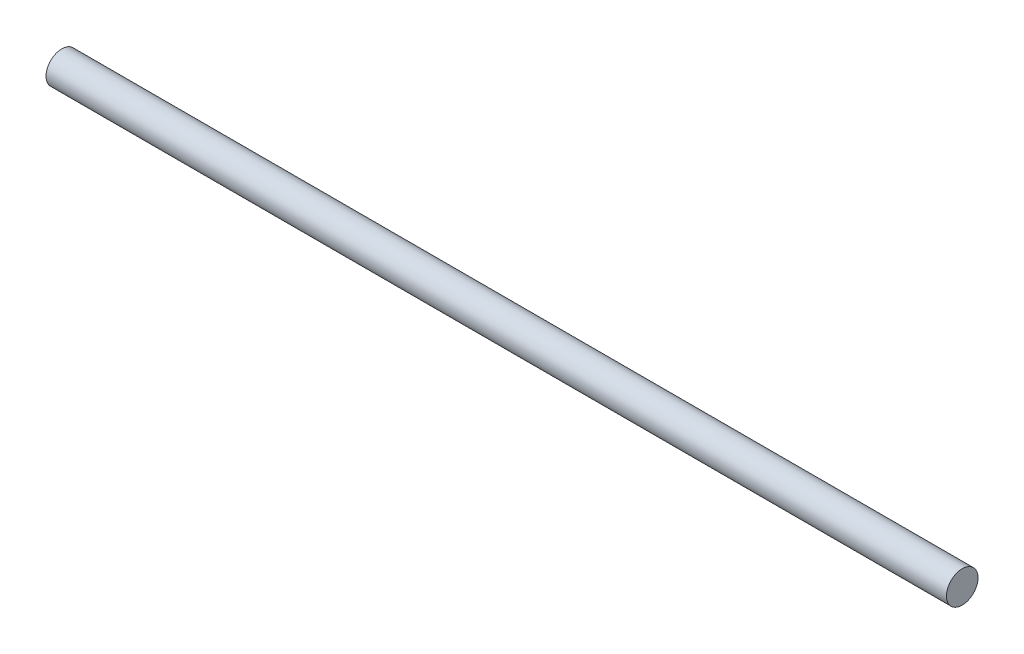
from build123d import *

# Parameters (mm, degrees)
SKETCH1_W = 361.95
SKETCH1_H = 6.35


with BuildPart() as part:
    # Sketch1 → Revolve1 (revolve)
    with BuildSketch(Plane.XY, mode=Mode.PRIVATE) as revolve1_sk:
        with Locations((180.975, 3.175)):
            Rectangle(SKETCH1_W, SKETCH1_H)
    revolve(revolve1_sk.sketch.rotate(Axis((361.95, 0, 0), (-1, 0, 0)), 270), axis=Axis((361.95, 0, 0), (-1, 0, 0)))


solid = part.part
